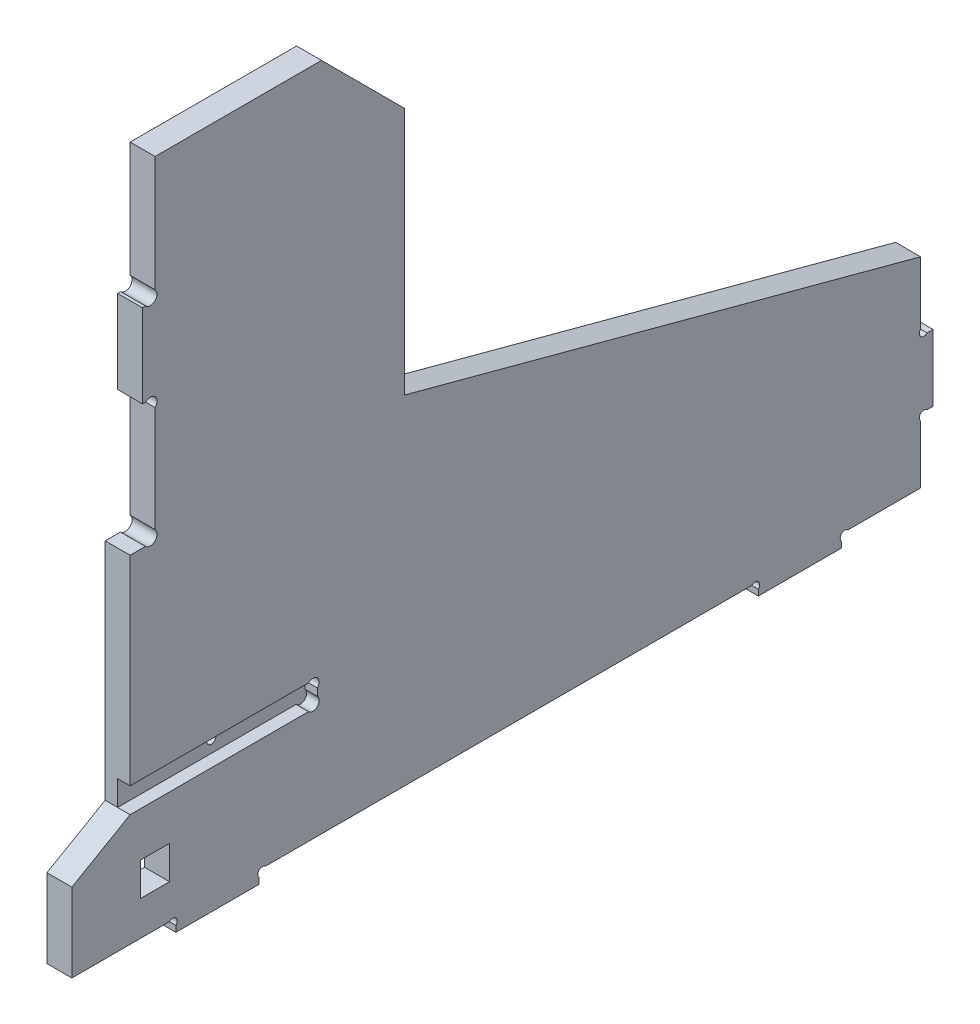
from build123d import *

# Parameters (mm, degrees)
ESQUISSE1_R             = 1.1
ESQUISSE1_W             = 7
ESQUISSE1_H             = 8
BOSS_EXTRU_1_DEPTH      = 6
ENL_V_MAT_EXTRU_1_DEPTH = 3


with BuildPart() as part:
    # Esquisse1 → Boss.-Extru.1 (new body)
    with BuildSketch(Plane(origin=(0, 0, 0), x_dir=(0, 0, -1), z_dir=(1, 0, 0))):
        with BuildLine():
            Line((20, 164), (20, 136.2627417))
            ThreePointArc((20, 136.2627417), (20, 134), (17.7372583, 134))
            Line((17.7372583, 134), (17, 134))
            Line((17, 134), (17, 114))
            Line((17, 114), (17.7372583, 114))
            ThreePointArc((17.7372583, 114), (20, 114), (20, 111.7372583))
            Line((20, 111.7372583), (20, 86.333452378))
            ThreePointArc((20, 86.333452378), (20, 84), (17.666547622, 84))
            Line((17.666547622, 84), (14, 84))
            Line((14, 84), (14, 30))
            Line((14, 30), (0, 21.917096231))
            Line((0, 21.917096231), (0, 3))
            Line((0, 3), (23.444365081, 3))
            ThreePointArc((23.444365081, 3), (25, 3), (25, 1.444365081))
            Line((25, 1.444365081), (25, 0))
            Line((25, 0), (45, 0))
            Line((45, 0), (45, 1.444365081))
            ThreePointArc((45, 1.444365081), (45, 3), (46.555634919, 3))
            Line((46.555634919, 3), (163.444365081, 3))
            ThreePointArc((163.444365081, 3), (165, 3), (165, 1.444365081))
            Line((165, 1.444365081), (165, 0))
            Line((165, 0), (185, 0))
            Line((185, 0), (185, 1.444365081))
            ThreePointArc((185, 1.444365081), (185, 3), (186.555634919, 3))
            Line((186.555634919, 3), (204, 3))
            Line((204, 3), (204, 16.944365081))
            ThreePointArc((204, 16.944365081), (204, 18.5), (205.555634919, 18.5))
            Line((205.555634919, 18.5), (207, 18.5))
            Line((207, 18.5), (207, 34.5))
            Line((207, 34.5), (205.555634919, 34.5))
            ThreePointArc((205.555634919, 34.5), (204, 34.5), (204, 36.055634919))
            Line((204, 36.055634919), (204, 51.13))
            Line((204, 51.13), (80, 84.355699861))
            Line((80, 84.355699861), (80, 144))
            Line((80, 144), (60, 164))
            Line((60, 164), (20, 164))
        make_face()
        with Locations((36.5, 33)):
            Circle(ESQUISSE1_R, mode=Mode.SUBTRACT)
        with Locations((19.98, 15.3)):
            Rectangle(ESQUISSE1_W, ESQUISSE1_H, mode=Mode.SUBTRACT)
    extrude(amount=BOSS_EXTRU_1_DEPTH)

    # Esquisse2 → Enl_v. mat.-Extru.1 (cut)
    with BuildSketch(Plane(origin=(6, 0, 0), x_dir=(0, 0, -1), z_dir=(1, 0, 0))):
        with BuildLine():
            Line((59, 33.878679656), (59, 32.121320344))
            ThreePointArc((59, 32.121320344), (59, 30), (56.878679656, 30))
            Line((56.878679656, 30), (14, 30))
            Line((14, 30), (14, 36))
            Line((14, 36), (56.878679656, 36))
            ThreePointArc((56.878679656, 36), (59, 36), (59, 33.878679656))
        make_face()
    extrude(amount=-ENL_V_MAT_EXTRU_1_DEPTH, mode=Mode.SUBTRACT)


solid = part.part
